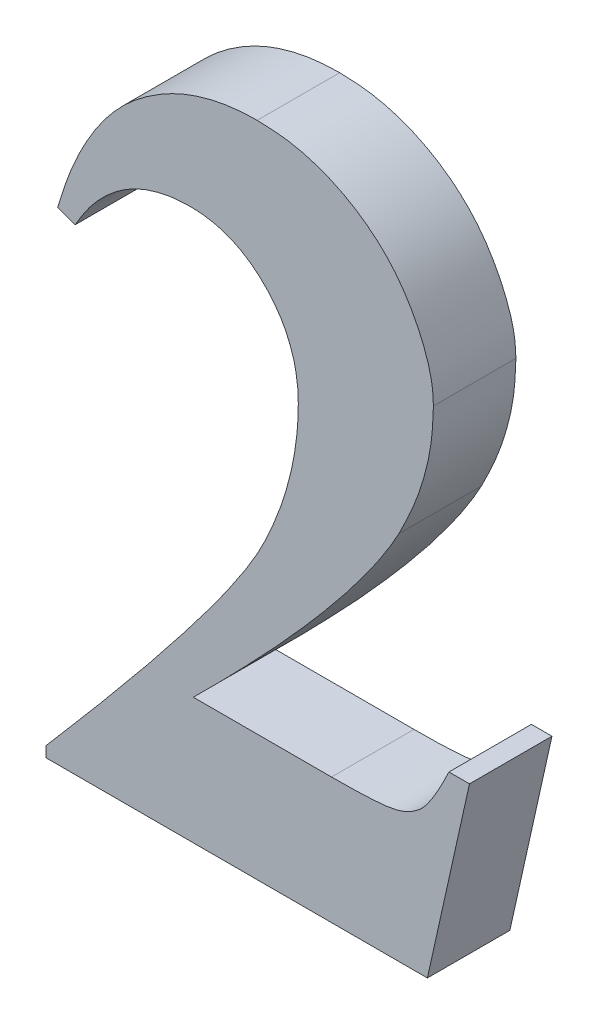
from build123d import *

# Parameters (mm, degrees)
SKETCH2_W          = 57.15
SKETCH2_H          = 57.15
BASE_EXTRUDE_DEPTH = 6.35
SKETCH4_OUTSIDE_W  = 75.364
SKETCH4_OUTSIDE_H  = 75.364
CUT_EXTRUDE1_DEPTH = 65.210401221


with BuildPart() as part:
    # Sketch2 → Base-Extrude (new body)
    with BuildSketch(Plane.XY):
        with Locations((0, 28.575)):
            Rectangle(SKETCH2_W, SKETCH2_H)
    extrude(amount=-BASE_EXTRUDE_DEPTH)

    # Sketch4 outside → Cut-Extrude1 (cut, through all)
    with BuildSketch(Plane.XY):
        with Locations((0, 28.575)):
            Rectangle(SKETCH4_OUTSIDE_W, SKETCH4_OUTSIDE_H)
        with BuildLine():
            Line((2.169720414, 0), (-27.187857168, 0))
            Line((-27.187857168, 0), (-27.187857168, 0.812779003))
            add(Edge.make_bspline(
                [(-27.187857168, 0.812779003), (-26.62394576, 1.469896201), (-25.522656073, 2.753211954), (-23.915161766, 4.639461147), (-22.401076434, 6.448306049), (-20.970557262, 8.171389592), (-19.622529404, 9.808020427), (-18.369329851, 11.368160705), (-17.19398836, 12.84181721), (-16.114396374, 14.239474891), (-15.11149011, 15.550099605), (-14.209476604, 16.784495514), (-13.37260593, 17.924008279), (-12.647239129, 18.994257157), (-11.983383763, 19.971856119), (-11.429846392, 20.878057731), (-10.942901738, 21.692754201), (-10.429550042, 22.669161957), (-9.887412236, 23.834114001), (-9.321174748, 25.211278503), (-8.840732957, 26.58152051), (-8.451225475, 27.945995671), (-8.145717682, 29.302717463), (-7.929284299, 30.648968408), (-7.792905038, 31.988155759), (-7.776194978, 32.879302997), (-7.767857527, 33.323939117)],
                knots=[0, 0, 0, 0, 1.612597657, 3.149319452, 4.61533888, 6.005555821, 7.320005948, 8.563963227, 9.732275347, 10.83031614, 11.852893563, 12.805518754, 13.677507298, 14.485488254, 15.213161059, 15.877772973, 16.462741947, 16.980353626, 17.931362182, 18.854577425, 19.75241868, 20.633982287, 21.495738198, 22.340708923, 23.172100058, 24, 24, 24, 24], degree=3))
            add(Edge.make_bspline(
                [(-7.767857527, 33.323939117), (-7.771811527, 33.638714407), (-7.779613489, 34.259823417), (-7.909806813, 35.16803453), (-8.083646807, 36.042674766), (-8.362848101, 36.866102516), (-8.696033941, 37.652879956), (-9.112407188, 38.398822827), (-9.612979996, 39.097900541), (-10.171243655, 39.758058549), (-10.787801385, 40.349781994), (-11.441096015, 40.877017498), (-12.132060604, 41.319323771), (-12.858386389, 41.682892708), (-13.613776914, 41.964671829), (-14.406708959, 42.15976123), (-15.230822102, 42.281499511), (-15.794077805, 42.298984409), (-16.079877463, 42.307856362)],
                knots=[0, 0, 0, 0, 1.105190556, 2.180742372, 3.219084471, 4.234827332, 5.230051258, 6.219020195, 7.229991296, 8.247636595, 9.253252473, 10.228765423, 11.193729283, 12.130555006, 13.078583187, 14.020812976, 14.995747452, 16, 16, 16, 16], degree=3))
            add(Edge.make_bspline(
                [(-16.079877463, 42.307856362), (-16.543786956, 42.293171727), (-17.454626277, 42.264339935), (-18.772973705, 41.979144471), (-20.018413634, 41.548705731), (-21.179643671, 40.920376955), (-22.254107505, 40.110774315), (-23.251511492, 39.130973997), (-24.167356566, 37.977801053), (-24.680308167, 37.109243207), (-24.944587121, 36.661751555)],
                knots=[0, 0, 0, 0, 1.004009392, 1.97127079, 2.909684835, 3.851879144, 4.819488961, 5.815961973, 6.87475683, 8, 8, 8, 8], degree=3))
            Line((-24.944587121, 36.661751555), (-26.299218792, 37.138581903))
            add(Edge.make_bspline(
                [(-26.299218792, 37.138581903), (-26.128041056, 37.696791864), (-25.79495524, 38.782983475), (-25.209888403, 40.342830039), (-24.547625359, 41.786081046), (-23.823893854, 43.118967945), (-23.041015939, 44.341946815), (-22.194652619, 45.456136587), (-21.274029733, 46.451358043), (-20.293689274, 47.335562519), (-19.2590806, 48.105096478), (-18.183302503, 48.780335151), (-17.067845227, 49.355939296), (-15.914653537, 49.824934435), (-14.723649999, 50.182399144), (-13.495732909, 50.445302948), (-12.225695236, 50.597078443), (-11.366149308, 50.619430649), (-10.932277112, 50.630713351)],
                knots=[0, 0, 0, 0, 1.266440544, 2.464300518, 3.610952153, 4.708568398, 5.751973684, 6.758226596, 7.739795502, 8.688661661, 9.618074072, 10.533472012, 11.441223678, 12.337640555, 13.230109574, 14.135388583, 15.058801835, 16, 16, 16, 16], degree=3))
            add(Edge.make_bspline(
                [(-10.932277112, 50.630713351), (-10.313209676, 50.610152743), (-9.091594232, 50.569580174), (-7.303725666, 50.239851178), (-5.604605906, 49.67859779), (-4.006962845, 48.911203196), (-2.530894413, 47.958519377), (-1.207735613, 46.836420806), (-0.057565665, 45.545594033), (0.886785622, 44.115487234), (1.648697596, 42.640625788), (2.208046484, 41.180942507), (2.570234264, 39.764284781), (2.61435537, 38.827492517), (2.635713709, 38.374005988)],
                knots=[0, 0, 0, 0, 1.104026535, 2.178592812, 3.23030043, 4.288289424, 5.332345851, 6.356517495, 7.374566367, 8.406013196, 9.406278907, 10.330385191, 11.191765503, 12, 12, 12, 12], degree=3))
            add(Edge.make_bspline(
                [(2.635713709, 38.374005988), (2.604586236, 37.562275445), (2.541481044, 35.916642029), (2.010382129, 33.449214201), (1.178413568, 30.959238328), (0.3868446, 29.356458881), (-0.019364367, 28.533961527)],
                knots=[0, 0, 0, 0, 0.945809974, 1.917454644, 2.931301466, 4, 4, 4, 4], degree=3))
            add(Edge.make_bspline(
                [(-0.019364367, 28.533961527), (-0.179344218, 28.243464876), (-0.509114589, 27.644657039), (-1.072659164, 26.743906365), (-1.682216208, 25.789231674), (-2.382170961, 24.805542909), (-3.142183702, 23.779706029), (-3.952233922, 22.695947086), (-4.856739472, 21.592001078), (-5.804595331, 20.428166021), (-6.831757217, 19.232643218), (-7.920007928, 17.994329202), (-9.072469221, 16.708583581), (-10.297970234, 15.387027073), (-11.594380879, 14.028024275), (-12.957006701, 12.62705194), (-14.369170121, 11.17103053), (-15.351866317, 10.202976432), (-15.852299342, 9.709999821)],
                knots=[0, 0, 0, 0, 0.645124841, 1.329811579, 2.066725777, 2.84865331, 3.678038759, 4.550980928, 5.480702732, 6.454414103, 7.471378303, 8.547119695, 9.661963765, 10.830736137, 12.053684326, 13.316184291, 14.633280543, 16, 16, 16, 16], degree=3))
            Line((-15.852299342, 9.709999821), (-5.210312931, 9.709999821))
            add(Edge.make_bspline(
                [(-5.210312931, 9.709999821), (-4.896000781, 9.707552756), (-4.299798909, 9.70291105), (-3.447568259, 9.734054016), (-2.680976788, 9.744887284), (-2.002347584, 9.794846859), (-1.409579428, 9.835921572), (-0.901725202, 9.88285978), (-0.480340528, 9.963092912), (0.152189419, 10.097862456), (0.961646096, 10.450586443), (1.745921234, 11.051176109), (2.288218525, 11.746980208), (2.756272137, 12.486409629), (3.287441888, 13.445766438), (3.636720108, 14.169233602), (3.82778958, 14.564999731)],
                knots=[0, 0, 0, 0, 1.165365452, 2.210519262, 3.16194188, 4.00752645, 4.732838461, 5.365956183, 5.896709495, 6.322409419, 7.76291752, 9.126907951, 9.936502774, 11.021415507, 12.370592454, 14, 14, 14, 14], degree=3))
            Line((3.82778958, 14.564999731), (5.409999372, 14.564999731))
            Line((5.409999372, 14.564999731), (2.169720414, 0))
        make_face(mode=Mode.SUBTRACT)
    extrude(amount=-CUT_EXTRUDE1_DEPTH, mode=Mode.SUBTRACT)


solid = part.part
